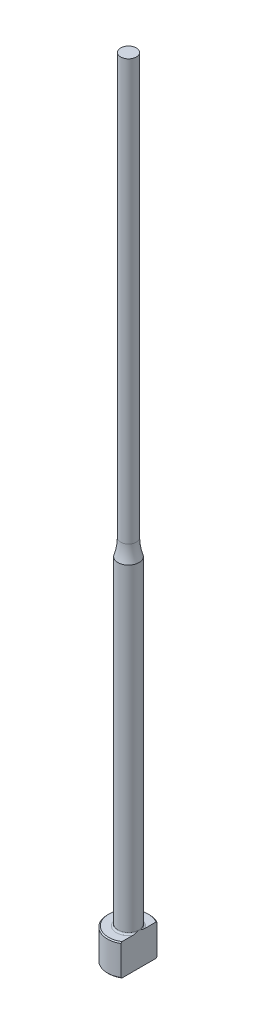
from build123d import *
from build123d.topology import SkipClean

# Parameters (mm, degrees)
CHAMFER1_SIZE    = 0.2
FILLET1_R        = 0.3
KEYED_HEAD_DEPTH = 151.106628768


with BuildPart() as part:
    # Sketch1 → Revolve1 (revolve)
    with BuildSketch(Plane.XY, mode=Mode.PRIVATE) as revolve1_sk:
        with BuildLine():
            Line((0, 0), (-4, 0))
            Line((-4, 0), (-4, 6))
            Line((-4, 6), (-2, 6))
            Line((-2, 6), (-2, 66.877501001))
            ThreePointArc((-2, 66.877501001), (-1.625791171, 68.41886117), (-1.5, 70))
            Line((-1.5, 70), (-1.5, 150))
            Line((-1.5, 150), (0, 150))
            Line((0, 150), (0, 0))
        make_face()
    revolve(revolve1_sk.sketch.rotate(Axis((0, 259.958771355, 0), (0, -1, 0)), 270), axis=Axis((0, 259.958771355, 0), (0, -1, 0)))

    # Chamfer1
    chamfer1_edges = [part.edges().sort_by_distance(p)[0] for p in [
        (0, 0, -4),
        (0, 6, -4),
    ]]
    chamfer(chamfer1_edges, length=CHAMFER1_SIZE)

    # Fillet1
    fillet1_edges = [part.edges().sort_by_distance(p)[0] for p in [
        (0, 6, -2),
    ]]
    fillet(fillet1_edges, radius=FILLET1_R)

    # Sketch2 → Keyed Head (cut, through all)
    with SkipClean():  # the faces are left unmerged after this step: merging them gives an invalid solid
        with BuildSketch(Plane(origin=(0, 0, 0), x_dir=(1, 0, 0), z_dir=(0, 1, 0))):
            with BuildLine():
                Line((2, -3.464101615), (2, 3.464101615))
                ThreePointArc((2, 3.464101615), (4, 0), (2, -3.464101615))
            make_face()
        extrude(amount=KEYED_HEAD_DEPTH, mode=Mode.SUBTRACT)


solid = part.part
